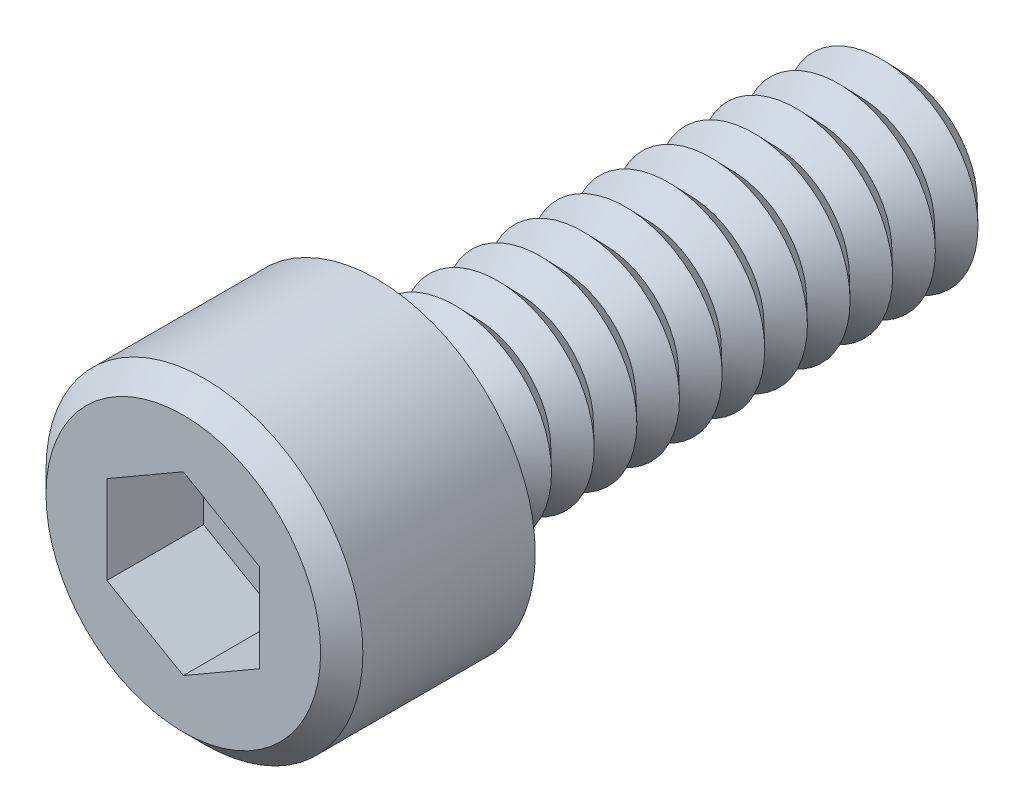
from build123d import *

# Parameters (mm, degrees)
SKETCH1_R     = 1.7526
SHANK_DEPTH   = 9.525
SKETCH2_R     = 2.8702
CAP_DEPTH     = 3.5052
FILLET1_R     = 0.254
HEXCUT_DEPTH  = 1.7526
CHAMFER1_SIZE = 0.382693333
THREADS_COUNT = 12
THREADS_PITCH = 0.772583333


with BuildPart() as part:
    # Sketch1 → Shank (new body)
    with BuildSketch(Plane.XY):
        with Locations(Location((0, 0, 0), (0, 0, 180))):
            Circle(SKETCH1_R)
    extrude(amount=SHANK_DEPTH)

    # Sketch2 → Cap (add)
    with BuildSketch(Plane.XY.offset(9.525)):
        Circle(SKETCH2_R)
    extrude(amount=CAP_DEPTH)

    # Fillet1
    fillet1_edges = [part.edges().sort_by_distance(p)[0] for p in [
        (1.7526, 0, 9.525),
    ]]
    fillet(fillet1_edges, radius=FILLET1_R)

    # Sketch3 → HexCut (cut)
    with BuildSketch(Plane(origin=(4.874850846, 0.925692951, 13.0302), x_dir=(1, 0, 0), z_dir=(0, 0, 1))):
        Polygon((-4.874850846, 0.672759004), (-3.490550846, -0.126466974), (-3.490550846, -1.724918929), (-4.874850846, -2.524144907), (-6.259150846, -1.724918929), (-6.259150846, -0.126466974), align=None)
    extrude(amount=-HEXCUT_DEPTH, mode=Mode.SUBTRACT)

    # Chamfer1
    chamfer1_edges = [part.edges().sort_by_distance(p)[0] for p in [
        (-2.8702, 0, 13.0302),
    ]]
    chamfer(chamfer1_edges, length=CHAMFER1_SIZE)

    # Sketch4 → Thread1 (revolve, cut)
    with BuildSketch(Plane(origin=(0, 0, 0), x_dir=(0, 0, -1), z_dir=(1, 0, 0)), mode=Mode.PRIVATE) as thread1_sk:
        Polygon((0, 1.35255), (0, 1.7526), (-0.386291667, 1.7526), align=None)
    thread1 = revolve(thread1_sk.sketch.rotate(Axis((0, 0, -27.010627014), (0, 0, 1)), 90), axis=Axis((0, 0, -27.010627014), (0, 0, 1)), mode=Mode.SUBTRACT)

    # Sketch5 → Thread2 (revolve, cut)
    with BuildSketch(Plane(origin=(0, 0, 0), x_dir=(0, 0, -1), z_dir=(1, 0, 0)), mode=Mode.PRIVATE) as thread2_sk:
        Polygon((-0.386291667, 1.7526), (-0.772583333, 1.35255), (-0.772583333, 1.7526), align=None)
    thread2 = revolve(thread2_sk.sketch.rotate(Axis((0, 0, 13.698066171), (0, 0, -1)), 270), axis=Axis((0, 0, 13.698066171), (0, 0, -1)), mode=Mode.SUBTRACT)

    # Threads: Thread1, Thread2 ×12
    with Locations(*[(0, 0, i * THREADS_PITCH) for i in range(1, THREADS_COUNT)]):
        add(thread1, mode=Mode.SUBTRACT)
        add(thread2, mode=Mode.SUBTRACT)


solid = part.part
